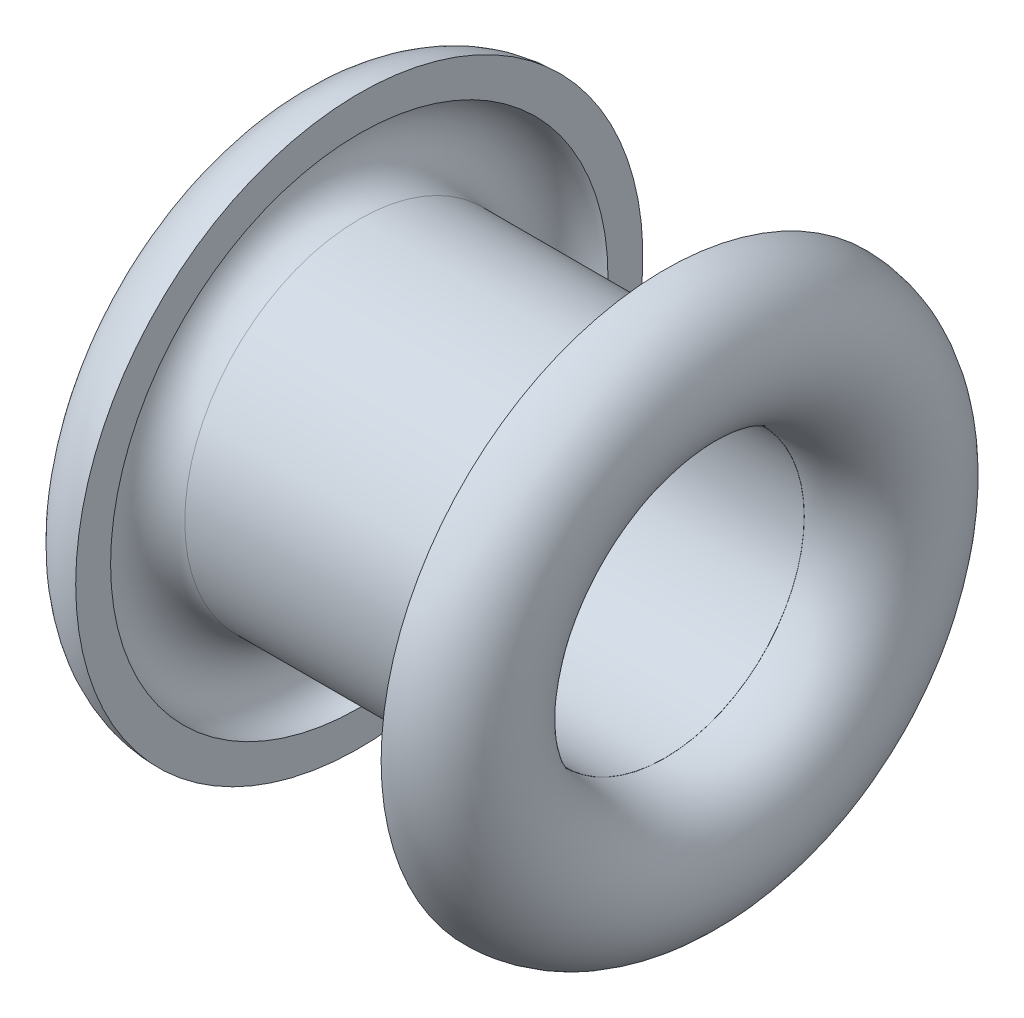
ISO-10303-21;
HEADER;
FILE_DESCRIPTION(('STEP AP214'),'2;1');
FILE_NAME('part.step','',(''),(''),'','','');
FILE_SCHEMA(('AUTOMOTIVE_DESIGN { 1 0 10303 214 1 1 1 1 }'));
ENDSEC;
DATA;
#1=APPLICATION_CONTEXT('core data for automotive mechanical design processes');
#2=APPLICATION_PROTOCOL_DEFINITION('international standard','automotive_design',2000,#1);
#3=PRODUCT_CONTEXT('',#1,'mechanical');
#4=PRODUCT('Part','Part','',(#3));
#5=PRODUCT_RELATED_PRODUCT_CATEGORY('part','',(#4));
#6=PRODUCT_DEFINITION_FORMATION('','',#4);
#7=PRODUCT_DEFINITION_CONTEXT('part definition',#1,'design');
#8=PRODUCT_DEFINITION('design','',#6,#7);
#9=PRODUCT_DEFINITION_SHAPE('','',#8);
#10=(LENGTH_UNIT() NAMED_UNIT(*) SI_UNIT(.MILLI.,.METRE.));
#11=(NAMED_UNIT(*) PLANE_ANGLE_UNIT() SI_UNIT($,.RADIAN.));
#12=(NAMED_UNIT(*) SI_UNIT($,.STERADIAN.) SOLID_ANGLE_UNIT());
#13=UNCERTAINTY_MEASURE_WITH_UNIT(LENGTH_MEASURE(1.E-05),#10,'distance_accuracy_value','');
#14=(GEOMETRIC_REPRESENTATION_CONTEXT(3) GLOBAL_UNCERTAINTY_ASSIGNED_CONTEXT((#13)) GLOBAL_UNIT_ASSIGNED_CONTEXT((#10,
#11,#12)) REPRESENTATION_CONTEXT('',''));
#15=CARTESIAN_POINT('',(0.,0.,0.));
#16=DIRECTION('',(0.,0.,1.));
#17=DIRECTION('',(1.,0.,0.));
#18=AXIS2_PLACEMENT_3D('',#15,#16,#17);
#19=CARTESIAN_POINT('',(0.,0.,0.));
#20=DIRECTION('',(-1.,0.,0.));
#21=DIRECTION('',(0.,0.,1.));
#22=AXIS2_PLACEMENT_3D('',#19,#20,#21);
#23=TOROIDAL_SURFACE('',#22,2.425,0.825);
#24=CARTESIAN_POINT('',(0.,0.,0.));
#25=DIRECTION('',(-1.,0.,0.));
#26=DIRECTION('',(0.,0.,1.));
#27=AXIS2_PLACEMENT_3D('',#24,#25,#26);
#28=CIRCLE('',#27,1.6);
#29=CARTESIAN_POINT('',(0.,0.,1.6));
#30=VERTEX_POINT('',#29);
#31=EDGE_CURVE('E10',#30,#30,#28,.T.);
#32=ORIENTED_EDGE('',*,*,#31,.F.);
#33=EDGE_LOOP('',(#32));
#34=FACE_BOUND('',#33,.T.);
#35=CARTESIAN_POINT('',(0.,0.,0.));
#36=DIRECTION('',(-1.,0.,0.));
#37=DIRECTION('',(0.,0.,1.));
#38=AXIS2_PLACEMENT_3D('',#35,#36,#37);
#39=CIRCLE('',#38,3.25);
#40=CARTESIAN_POINT('',(0.,0.,3.25));
#41=VERTEX_POINT('',#40);
#42=EDGE_CURVE('E41',#41,#41,#39,.T.);
#43=ORIENTED_EDGE('',*,*,#42,.T.);
#44=EDGE_LOOP('',(#43));
#45=FACE_BOUND('',#44,.T.);
#46=ADVANCED_FACE('F30',(#34,#45),#23,.T.);
#47=CARTESIAN_POINT('',(0.,0.,0.));
#48=DIRECTION('',(-1.,0.,0.));
#49=DIRECTION('',(0.,0.,1.));
#50=AXIS2_PLACEMENT_3D('',#47,#48,#49);
#51=TOROIDAL_SURFACE('',#50,2.425,0.425);
#52=CARTESIAN_POINT('',(0.,0.,0.));
#53=DIRECTION('',(-1.,0.,0.));
#54=DIRECTION('',(0.,0.,1.));
#55=AXIS2_PLACEMENT_3D('',#52,#53,#54);
#56=CIRCLE('',#55,2.85);
#57=CARTESIAN_POINT('',(0.,0.,2.85));
#58=VERTEX_POINT('',#57);
#59=EDGE_CURVE('E36',#58,#58,#56,.T.);
#60=ORIENTED_EDGE('',*,*,#59,.F.);
#61=EDGE_LOOP('',(#60));
#62=FACE_BOUND('',#61,.T.);
#63=CARTESIAN_POINT('',(0.,0.,0.));
#64=DIRECTION('',(1.,0.,0.));
#65=DIRECTION('',(0.,0.,-1.));
#66=AXIS2_PLACEMENT_3D('',#63,#64,#65);
#67=CIRCLE('',#66,2.);
#68=CARTESIAN_POINT('',(0.,0.,-2.));
#69=VERTEX_POINT('',#68);
#70=EDGE_CURVE('E49',#69,#69,#67,.T.);
#71=ORIENTED_EDGE('',*,*,#70,.F.);
#72=EDGE_LOOP('',(#71));
#73=FACE_BOUND('',#72,.T.);
#74=ADVANCED_FACE('F122',(#62,#73),#51,.F.);
#75=CARTESIAN_POINT('',(0.,3.25,0.));
#76=DIRECTION('',(-1.,0.,0.));
#77=DIRECTION('',(0.,0.,1.));
#78=AXIS2_PLACEMENT_3D('',#75,#76,#77);
#79=PLANE('',#78);
#80=ORIENTED_EDGE('',*,*,#42,.F.);
#81=EDGE_LOOP('',(#80));
#82=FACE_BOUND('',#81,.T.);
#83=ORIENTED_EDGE('',*,*,#59,.T.);
#84=EDGE_LOOP('',(#83));
#85=FACE_BOUND('',#84,.T.);
#86=ADVANCED_FACE('F117',(#82,#85),#79,.F.);
#87=CARTESIAN_POINT('',(0.,0.,0.));
#88=DIRECTION('',(1.,0.,0.));
#89=DIRECTION('',(0.,0.,-1.));
#90=AXIS2_PLACEMENT_3D('',#87,#88,#89);
#91=PLANE('',#90);
#92=CARTESIAN_POINT('',(0.,0.,0.));
#93=DIRECTION('',(1.,0.,0.));
#94=DIRECTION('',(0.,0.,-1.));
#95=AXIS2_PLACEMENT_3D('',#92,#93,#94);
#96=CIRCLE('',#95,1.59826215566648);
#97=CARTESIAN_POINT('',(0.,0.,-1.59826215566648));
#98=VERTEX_POINT('',#97);
#99=EDGE_CURVE('E54',#98,#98,#96,.T.);
#100=ORIENTED_EDGE('',*,*,#99,.T.);
#101=EDGE_LOOP('',(#100));
#102=FACE_BOUND('',#101,.T.);
#103=ORIENTED_EDGE('',*,*,#31,.T.);
#104=EDGE_LOOP('',(#103));
#105=FACE_BOUND('',#104,.T.);
#106=ADVANCED_FACE('F108',(#102,#105),#91,.F.);
#107=CARTESIAN_POINT('',(1.75,0.,0.));
#108=DIRECTION('',(-1.,0.,0.));
#109=DIRECTION('',(0.,0.,1.));
#110=AXIS2_PLACEMENT_3D('',#107,#108,#109);
#111=CYLINDRICAL_SURFACE('',#110,2.);
#112=ORIENTED_EDGE('',*,*,#70,.T.);
#113=EDGE_LOOP('',(#112));
#114=FACE_BOUND('',#113,.T.);
#115=CARTESIAN_POINT('',(3.5,0.,0.));
#116=DIRECTION('',(1.,0.,0.));
#117=DIRECTION('',(0.,0.,-1.));
#118=AXIS2_PLACEMENT_3D('',#115,#116,#117);
#119=CIRCLE('',#118,2.);
#120=CARTESIAN_POINT('',(3.5,0.,-2.));
#121=VERTEX_POINT('',#120);
#122=EDGE_CURVE('E67',#121,#121,#119,.T.);
#123=ORIENTED_EDGE('',*,*,#122,.F.);
#124=EDGE_LOOP('',(#123));
#125=FACE_BOUND('',#124,.T.);
#126=ADVANCED_FACE('F106',(#114,#125),#111,.T.);
#127=CARTESIAN_POINT('',(1.75,0.,0.));
#128=DIRECTION('',(-1.,0.,0.));
#129=DIRECTION('',(0.,0.,1.));
#130=AXIS2_PLACEMENT_3D('',#127,#128,#129);
#131=CYLINDRICAL_SURFACE('',#130,1.59826215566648);
#132=ORIENTED_EDGE('',*,*,#99,.F.);
#133=EDGE_LOOP('',(#132));
#134=FACE_BOUND('',#133,.T.);
#135=CARTESIAN_POINT('',(3.5,0.,0.));
#136=DIRECTION('',(1.,0.,0.));
#137=DIRECTION('',(0.,0.,-1.));
#138=AXIS2_PLACEMENT_3D('',#135,#136,#137);
#139=CIRCLE('',#138,1.59826215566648);
#140=CARTESIAN_POINT('',(3.5,0.,-1.59826215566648));
#141=VERTEX_POINT('',#140);
#142=EDGE_CURVE('E71',#141,#141,#139,.T.);
#143=ORIENTED_EDGE('',*,*,#142,.T.);
#144=EDGE_LOOP('',(#143));
#145=FACE_BOUND('',#144,.T.);
#146=ADVANCED_FACE('F80',(#134,#145),#131,.F.);
#147=CARTESIAN_POINT('',(3.5,0.,0.));
#148=DIRECTION('',(1.,0.,0.));
#149=DIRECTION('',(0.,0.,1.));
#150=AXIS2_PLACEMENT_3D('',#147,#148,#149);
#151=TOROIDAL_SURFACE('',#150,2.425,0.825);
#152=CARTESIAN_POINT('',(3.5,0.,0.));
#153=DIRECTION('',(-1.,0.,0.));
#154=DIRECTION('',(0.,0.,1.));
#155=AXIS2_PLACEMENT_3D('',#152,#153,#154);
#156=CIRCLE('',#155,1.6);
#157=CARTESIAN_POINT('',(3.5,0.,1.6));
#158=VERTEX_POINT('',#157);
#159=EDGE_CURVE('E57',#158,#158,#156,.T.);
#160=ORIENTED_EDGE('',*,*,#159,.T.);
#161=EDGE_LOOP('',(#160));
#162=FACE_BOUND('',#161,.T.);
#163=CARTESIAN_POINT('',(3.5,0.,0.));
#164=DIRECTION('',(-1.,0.,0.));
#165=DIRECTION('',(0.,0.,1.));
#166=AXIS2_PLACEMENT_3D('',#163,#164,#165);
#167=CIRCLE('',#166,3.25);
#168=CARTESIAN_POINT('',(3.5,0.,3.25));
#169=VERTEX_POINT('',#168);
#170=EDGE_CURVE('E63',#169,#169,#167,.T.);
#171=ORIENTED_EDGE('',*,*,#170,.F.);
#172=EDGE_LOOP('',(#171));
#173=FACE_BOUND('',#172,.T.);
#174=ADVANCED_FACE('F89',(#162,#173),#151,.T.);
#175=CARTESIAN_POINT('',(3.5,0.,0.));
#176=DIRECTION('',(1.,0.,0.));
#177=DIRECTION('',(0.,0.,1.));
#178=AXIS2_PLACEMENT_3D('',#175,#176,#177);
#179=TOROIDAL_SURFACE('',#178,2.425,0.425);
#180=CARTESIAN_POINT('',(3.5,0.,0.));
#181=DIRECTION('',(-1.,0.,0.));
#182=DIRECTION('',(0.,0.,1.));
#183=AXIS2_PLACEMENT_3D('',#180,#181,#182);
#184=CIRCLE('',#183,2.85);
#185=CARTESIAN_POINT('',(3.5,0.,2.85));
#186=VERTEX_POINT('',#185);
#187=EDGE_CURVE('E60',#186,#186,#184,.T.);
#188=ORIENTED_EDGE('',*,*,#187,.T.);
#189=EDGE_LOOP('',(#188));
#190=FACE_BOUND('',#189,.T.);
#191=ORIENTED_EDGE('',*,*,#122,.T.);
#192=EDGE_LOOP('',(#191));
#193=FACE_BOUND('',#192,.T.);
#194=ADVANCED_FACE('F92',(#190,#193),#179,.F.);
#195=CARTESIAN_POINT('',(3.5,3.25,0.));
#196=DIRECTION('',(1.,0.,0.));
#197=DIRECTION('',(0.,0.,1.));
#198=AXIS2_PLACEMENT_3D('',#195,#196,#197);
#199=PLANE('',#198);
#200=ORIENTED_EDGE('',*,*,#170,.T.);
#201=EDGE_LOOP('',(#200));
#202=FACE_BOUND('',#201,.T.);
#203=ORIENTED_EDGE('',*,*,#187,.F.);
#204=EDGE_LOOP('',(#203));
#205=FACE_BOUND('',#204,.T.);
#206=ADVANCED_FACE('F85',(#202,#205),#199,.F.);
#207=CARTESIAN_POINT('',(3.5,0.,0.));
#208=DIRECTION('',(-1.,0.,0.));
#209=DIRECTION('',(0.,0.,-1.));
#210=AXIS2_PLACEMENT_3D('',#207,#208,#209);
#211=PLANE('',#210);
#212=ORIENTED_EDGE('',*,*,#142,.F.);
#213=EDGE_LOOP('',(#212));
#214=FACE_BOUND('',#213,.T.);
#215=ORIENTED_EDGE('',*,*,#159,.F.);
#216=EDGE_LOOP('',(#215));
#217=FACE_BOUND('',#216,.T.);
#218=ADVANCED_FACE('F82',(#214,#217),#211,.F.);
#219=CLOSED_SHELL('',(#46,#74,#86,#106,#126,#146,#174,#194,#206,#218));
#220=MANIFOLD_SOLID_BREP('B2',#219);
#221=ADVANCED_BREP_SHAPE_REPRESENTATION('',(#18,#220),#14);
#222=SHAPE_DEFINITION_REPRESENTATION(#9,#221);
ENDSEC;
END-ISO-10303-21;
